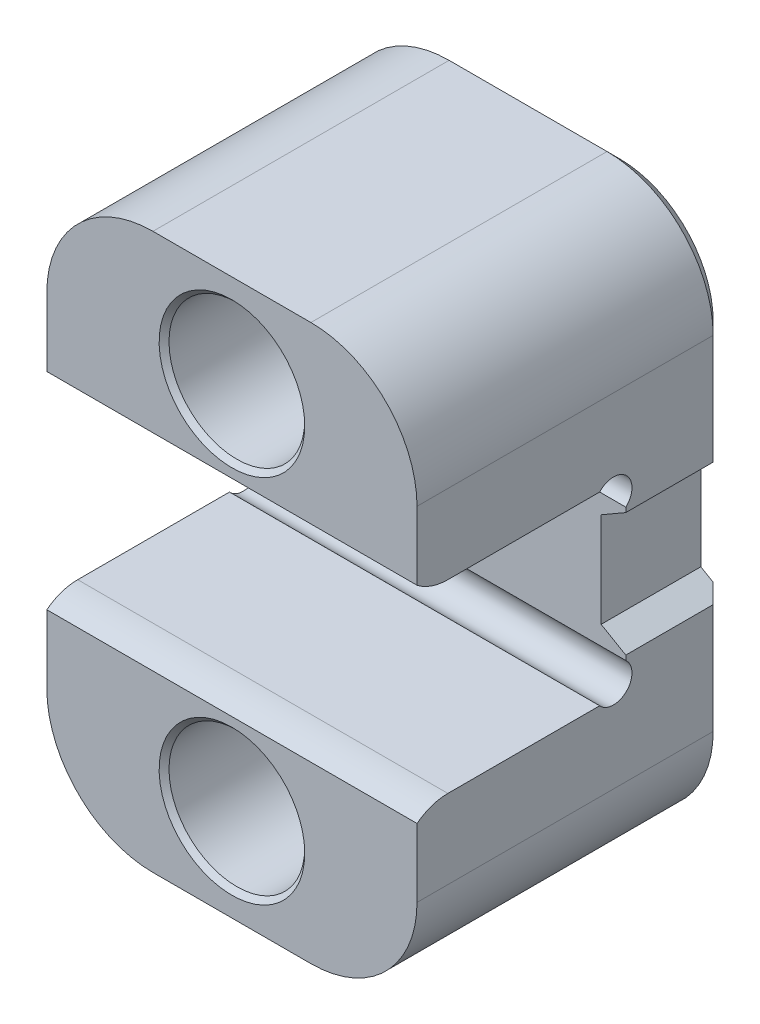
from build123d import *

# Parameters (mm, degrees)
EXTRUDE1_DEPTH                 = 15
FILLET1_R                      = 8.6
CUT_EXTRUDE1_DEPTH             = 44.130615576
CUT_EXTRUDE2_DEPTH             = 46.069390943
SKETCH6_R                      = 1.5
CUT_EXTRUDE3_DEPTH             = 46.069390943
CBORE_FOR_M6_SHCS1_D           = 7
CBORE_FOR_M6_SHCS1_CBORE_D     = 11
CBORE_FOR_M6_SHCS1_CBORE_DEPTH = 9
CHAMFER1_SIZE                  = 1
CHAMFER3_SIZE                  = 0.4


with BuildPart() as part:
    # Sketch1 → Extrude1 (new, symmetric)
    with BuildSketch(Plane(origin=(0, 0, 0), x_dir=(0, 0, -1), z_dir=(1, 0, 0))):
        Polygon((0, 7.5), (16.92, 7.5), (16.92, -7.5), (0, -7.5), (0, -22.5), (25, -22.5), (25, 22.5), (0, 22.5), align=None)
    extrude(amount=EXTRUDE1_DEPTH, both=True)

    # Fillet1
    fillet1_edges = [part.edges().sort_by_distance(p)[0] for p in [
        (15, -22.5, -12.5),
        (15, 22.5, -12.5),
        (-15, 22.5, -12.5),
        (-15, -22.5, -12.5),
    ]]
    fillet(fillet1_edges, radius=FILLET1_R)

    # Sketch2 → Cut-Extrude1 (cut, through all)
    with BuildSketch(Plane(origin=(-12, 0, 0), x_dir=(1, 0, 0), z_dir=(0, 0, 1))):
        Polygon((25, -3.845299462), (27, -5), (27, 5), (25, 3.845299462), align=None)
    extrude(amount=-CUT_EXTRUDE1_DEPTH, mode=Mode.SUBTRACT)

    # Sketch5 → Cut-Extrude2 (cut, through all)
    with BuildSketch(Plane(origin=(15, 0, 0), x_dir=(0, 0, -1), z_dir=(1, 0, 0))):
        with BuildLine():
            Line((-7.5, -3.359035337), (2.5, -3.359035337))
            Line((2.5, -3.359035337), (2.5, -7.5))
            ThreePointArc((2.5, -7.5), (1.17826423, -7.720749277), (0, -8.359035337))
            Line((0, -8.359035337), (-7.5, -8.359035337))
            Line((-7.5, -8.359035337), (-7.5, -3.359035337))
        make_face()
        with BuildLine():
            Line((2.5, 3.359035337), (2.5, 7.5))
            ThreePointArc((2.5, 7.5), (1.17826423, 7.720749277), (0, 8.359035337))
            Line((0, 8.359035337), (-7.5, 8.359035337))
            Line((-7.5, 8.359035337), (-7.5, 3.359035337))
            Line((-7.5, 3.359035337), (2.5, 3.359035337))
        make_face()
    extrude(amount=-CUT_EXTRUDE2_DEPTH, mode=Mode.SUBTRACT)

    # Sketch6 → Cut-Extrude3 (cut, through all)
    with BuildSketch(Plane(origin=(15, 0, 0), x_dir=(0, 0, -1), z_dir=(1, 0, 0))):
        with Locations((15.92, 6.5)):
            Circle(SKETCH6_R)
        with Locations((15.92, -6.5)):
            Circle(SKETCH6_R)
    extrude(amount=-CUT_EXTRUDE3_DEPTH, mode=Mode.SUBTRACT)

    # CBORE for M6 SHCS1 (through all)
    with Locations(Plane.XY):
        with Locations((0, 15), (0, -15)):
            CounterBoreHole(CBORE_FOR_M6_SHCS1_D / 2, CBORE_FOR_M6_SHCS1_CBORE_D / 2, CBORE_FOR_M6_SHCS1_CBORE_DEPTH)

    # Chamfer1
    chamfer1_edges = [part.edges().sort_by_distance(p)[0] for p in [
        (15, -9.45, -25),
        (-15, 0, -25),
        (0, 22.5, -25),
        (0, -22.5, -25),
        (-12.481118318, 19.981118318, -25),
        (-12.481118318, -19.981118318, -25),
        (12.481118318, 19.981118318, -25),
        (12.481118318, -19.981118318, -25),
        (15, 9.45, -25),
    ]]
    chamfer(chamfer1_edges, length=CHAMFER1_SIZE)

    # Chamfer3
    chamfer3_edges = [part.edges().sort_by_distance(p)[0] for p in [
        (-5.5, -15, 0),
        (-5.5, 15, 0),
    ]]
    chamfer(chamfer3_edges, length=CHAMFER3_SIZE)


solid = part.part
